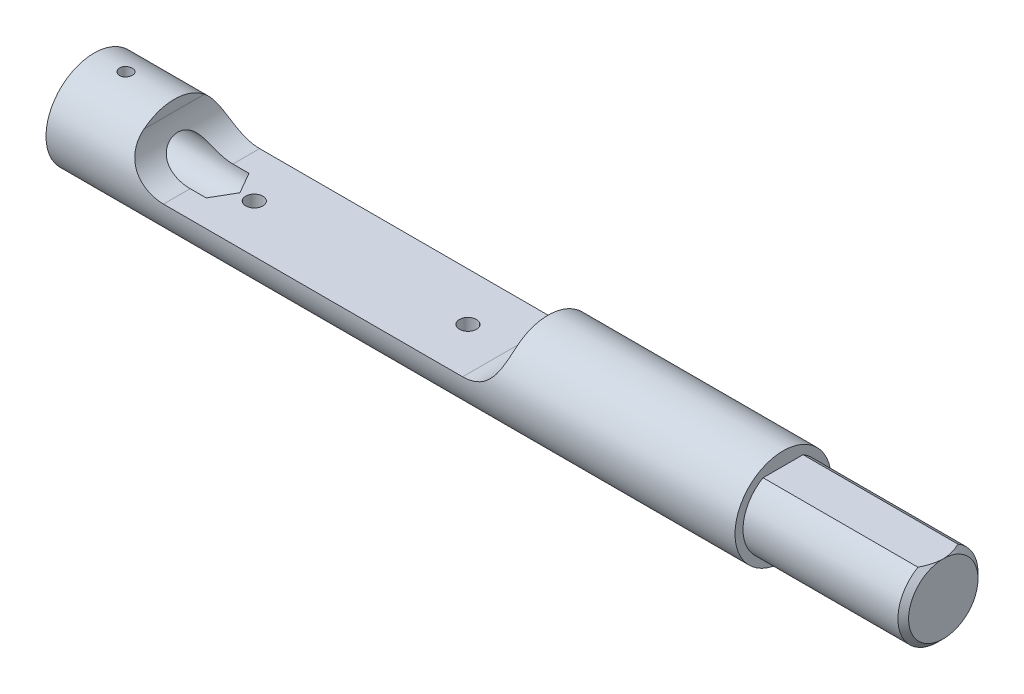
from build123d import *

# Parameters (mm, degrees)
CHANFREIN1_SIZE              = 1
ENL_V_MAT_EXTRU_1_DEPTH      = 160.508620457
ENL_V_MAT_EXTRU_1_DEPTH_BACK = 160.508620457
ESQUISSE3_W                  = 30
ESQUISSE3_H                  = 1
PER_AGE1_D                   = 8
PER_AGE1_DEPTH               = 25
PER_AGE1_TIP                 = 2.309401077
ESQUISSE6_R                  = 1.6
ENL_V_MAT_EXTRU_2_DEPTH      = 160.508620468
R_P_TITION_LIN_AIRE1_COUNT   = 2
R_P_TITION_LIN_AIRE1_PITCH   = 40
ESQUISSE7_R                  = 1.2
ENL_V_MAT_EXTRU_3_DEPTH      = 160.50862047


with BuildPart() as part:
    # Esquisse1 → Base-R_volution (revolve)
    with BuildSketch(Plane.XY, mode=Mode.PRIVATE) as base_r_volution_sk:
        Polygon((0, 0), (0, 9), (129, 9), (129, 7.5), (159, 7.5), (159, 0), align=None)
    revolve(base_r_volution_sk.sketch.rotate(Axis((0, 0, 0), (1, 0, 0)), 90), axis=Axis((0, 0, 0), (1, 0, 0)))

    # Chanfrein1
    chanfrein1_edges = [part.edges().sort_by_distance(p)[0] for p in [
        (159, 0, -7.5),
    ]]
    chamfer(chanfrein1_edges, length=CHANFREIN1_SIZE)

    # Esquisse3 → Enl_v. mat.-Extru.1 (cut, two sides: drawn at the far end of the back side and taken through both)
    with BuildSketch(Plane.XY.offset(-ENL_V_MAT_EXTRU_1_DEPTH_BACK)):
        with Locations((144, 7)):
            Rectangle(ESQUISSE3_W, ESQUISSE3_H)
        with BuildLine():
            Line((85, 9), (15, 9))
            Line((15, 9), (15, 7))
            ThreePointArc((15, 7), (17.050252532, 2.050252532), (22, 0))
            Line((22, 0), (78, 0))
            ThreePointArc((78, 0), (82.949747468, 2.050252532), (85, 7))
            Line((85, 7), (85, 9))
        make_face()
    extrude(amount=ENL_V_MAT_EXTRU_1_DEPTH + ENL_V_MAT_EXTRU_1_DEPTH_BACK, mode=Mode.SUBTRACT)

    # Per_age1
    with Locations(Plane.ZY):
        with Locations((0, 0)):
            Hole(PER_AGE1_D / 2, depth=PER_AGE1_DEPTH)
            with Locations((0, 0, -(PER_AGE1_DEPTH + PER_AGE1_TIP / 2))):  # 120° drill point
                Cone(0, PER_AGE1_D / 2, PER_AGE1_TIP, mode=Mode.SUBTRACT)

    # Esquisse6 → Enl_v. mat.-Extru.2 (cut, through all)
    with BuildSketch(Plane(origin=(0, 0, 0), x_dir=(-1, 0, 0), z_dir=(0, 1, 0))):
        with Locations(Location((-30, 0, 0), (0, 0, 90))):
            Circle(ESQUISSE6_R)
    enl_v_mat_extru_2 = extrude(amount=-ENL_V_MAT_EXTRU_2_DEPTH, mode=Mode.SUBTRACT)

    # R_p_tition lin_aire1: Enl_v. mat.-Extru.2 ×2
    with Locations(*[(i * R_P_TITION_LIN_AIRE1_PITCH, 0, 0) for i in range(1, R_P_TITION_LIN_AIRE1_COUNT)]):
        add(enl_v_mat_extru_2, mode=Mode.SUBTRACT)

    # Esquisse7 → Enl_v. mat.-Extru.3 (cut, through all)
    with BuildSketch(Plane(origin=(0, 0, 0), x_dir=(-1, 0, 0), z_dir=(0, 1, 0))):
        with Locations(Location((-6, 0, 0), (0, 0, 270))):
            Circle(ESQUISSE7_R)
    extrude(amount=ENL_V_MAT_EXTRU_3_DEPTH, mode=Mode.SUBTRACT)


solid = part.part
